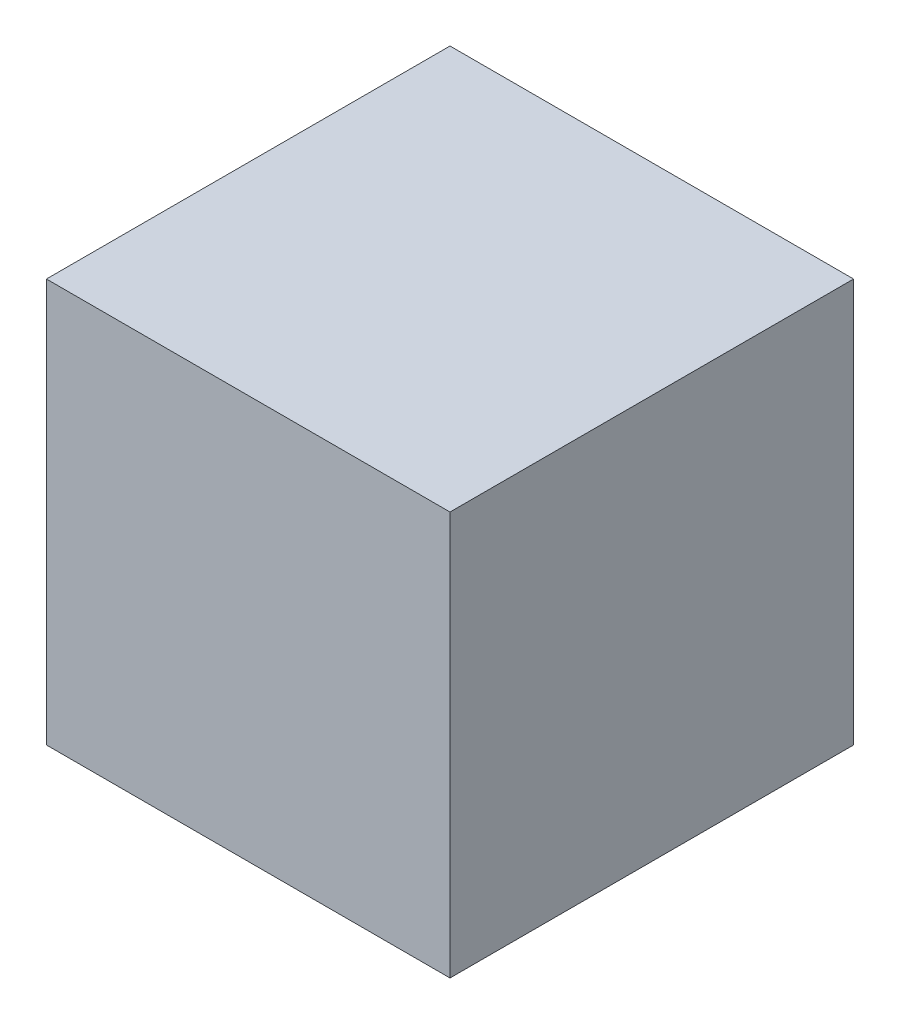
ISO-10303-21;
HEADER;
FILE_DESCRIPTION(('STEP AP214'),'2;1');
FILE_NAME('part.step','',(''),(''),'','','');
FILE_SCHEMA(('AUTOMOTIVE_DESIGN { 1 0 10303 214 1 1 1 1 }'));
ENDSEC;
DATA;
#1=APPLICATION_CONTEXT('core data for automotive mechanical design processes');
#2=APPLICATION_PROTOCOL_DEFINITION('international standard','automotive_design',2000,#1);
#3=PRODUCT_CONTEXT('',#1,'mechanical');
#4=PRODUCT('Part','Part','',(#3));
#5=PRODUCT_RELATED_PRODUCT_CATEGORY('part','',(#4));
#6=PRODUCT_DEFINITION_FORMATION('','',#4);
#7=PRODUCT_DEFINITION_CONTEXT('part definition',#1,'design');
#8=PRODUCT_DEFINITION('design','',#6,#7);
#9=PRODUCT_DEFINITION_SHAPE('','',#8);
#10=(LENGTH_UNIT() NAMED_UNIT(*) SI_UNIT(.MILLI.,.METRE.));
#11=(NAMED_UNIT(*) PLANE_ANGLE_UNIT() SI_UNIT($,.RADIAN.));
#12=(NAMED_UNIT(*) SI_UNIT($,.STERADIAN.) SOLID_ANGLE_UNIT());
#13=UNCERTAINTY_MEASURE_WITH_UNIT(LENGTH_MEASURE(1.E-05),#10,'distance_accuracy_value','');
#14=(GEOMETRIC_REPRESENTATION_CONTEXT(3) GLOBAL_UNCERTAINTY_ASSIGNED_CONTEXT((#13)) GLOBAL_UNIT_ASSIGNED_CONTEXT((#10,
#11,#12)) REPRESENTATION_CONTEXT('',''));
#15=CARTESIAN_POINT('',(0.,0.,0.));
#16=DIRECTION('',(0.,0.,1.));
#17=DIRECTION('',(1.,0.,0.));
#18=AXIS2_PLACEMENT_3D('',#15,#16,#17);
#19=CARTESIAN_POINT('',(-166.666666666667,83.3333333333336,-83.3333333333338));
#20=DIRECTION('',(-0.577350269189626,-0.577350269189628,0.577350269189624));
#21=DIRECTION('',(-0.707106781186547,0.707106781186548,0.));
#22=AXIS2_PLACEMENT_3D('',#19,#20,#21);
#23=PLANE('',#22);
#24=DIRECTION('',(-0.707106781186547,0.,-0.707106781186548));
#25=VECTOR('',#24,1.);
#26=CARTESIAN_POINT('',(-1.66533453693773E-13,250.,250.));
#27=LINE('',#26,#25);
#28=CARTESIAN_POINT('',(0.,250.,250.));
#29=VERTEX_POINT('',#28);
#30=CARTESIAN_POINT('',(-250.,250.,0.));
#31=VERTEX_POINT('',#30);
#32=EDGE_CURVE('E90',#29,#31,#27,.T.);
#33=ORIENTED_EDGE('',*,*,#32,.T.);
#34=DIRECTION('',(0.707106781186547,-0.707106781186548,0.));
#35=VECTOR('',#34,1.);
#36=CARTESIAN_POINT('',(-250.,250.,0.));
#37=LINE('',#36,#35);
#38=CARTESIAN_POINT('',(0.,0.,-3.7470027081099E-13));
#39=VERTEX_POINT('',#38);
#40=EDGE_CURVE('E88',#31,#39,#37,.T.);
#41=ORIENTED_EDGE('',*,*,#40,.T.);
#42=DIRECTION('',(0.,-0.707106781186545,-0.70710678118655));
#43=VECTOR('',#42,1.);
#44=CARTESIAN_POINT('',(1.94289029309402E-13,249.999999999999,250.));
#45=LINE('',#44,#43);
#46=EDGE_CURVE('E56',#29,#39,#45,.T.);
#47=ORIENTED_EDGE('',*,*,#46,.F.);
#48=EDGE_LOOP('',(#33,#41,#47));
#49=FACE_BOUND('',#48,.T.);
#50=ADVANCED_FACE('F53',(#49),#23,.T.);
#51=CARTESIAN_POINT('',(166.666666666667,83.3333333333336,-83.3333333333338));
#52=DIRECTION('',(0.577350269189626,-0.577350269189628,0.577350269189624));
#53=DIRECTION('',(0.707106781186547,0.707106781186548,0.));
#54=AXIS2_PLACEMENT_3D('',#51,#52,#53);
#55=PLANE('',#54);
#56=DIRECTION('',(0.707106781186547,0.,-0.707106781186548));
#57=VECTOR('',#56,1.);
#58=CARTESIAN_POINT('',(1.66533453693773E-13,250.,250.));
#59=LINE('',#58,#57);
#60=CARTESIAN_POINT('',(250.,250.,0.));
#61=VERTEX_POINT('',#60);
#62=EDGE_CURVE('E83',#29,#61,#59,.T.);
#63=ORIENTED_EDGE('',*,*,#62,.F.);
#64=ORIENTED_EDGE('',*,*,#46,.T.);
#65=DIRECTION('',(-0.707106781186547,-0.707106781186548,0.));
#66=VECTOR('',#65,1.);
#67=CARTESIAN_POINT('',(250.,250.,0.));
#68=LINE('',#67,#66);
#69=EDGE_CURVE('E72',#61,#39,#68,.T.);
#70=ORIENTED_EDGE('',*,*,#69,.F.);
#71=EDGE_LOOP('',(#63,#64,#70));
#72=FACE_BOUND('',#71,.T.);
#73=ADVANCED_FACE('F96',(#72),#55,.T.);
#74=CARTESIAN_POINT('',(-166.666666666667,333.333333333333,-166.666666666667));
#75=DIRECTION('',(-0.577350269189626,-0.577350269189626,-0.577350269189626));
#76=DIRECTION('',(-0.707106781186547,0.,0.707106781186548));
#77=AXIS2_PLACEMENT_3D('',#74,#75,#76);
#78=PLANE('',#77);
#79=ORIENTED_EDGE('',*,*,#40,.F.);
#80=DIRECTION('',(0.707106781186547,0.,-0.707106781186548));
#81=VECTOR('',#80,1.);
#82=CARTESIAN_POINT('',(-250.,250.,0.));
#83=LINE('',#82,#81);
#84=CARTESIAN_POINT('',(0.,250.000000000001,-250.));
#85=VERTEX_POINT('',#84);
#86=EDGE_CURVE('E101',#31,#85,#83,.T.);
#87=ORIENTED_EDGE('',*,*,#86,.T.);
#88=DIRECTION('',(0.,0.707106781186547,-0.707106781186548));
#89=VECTOR('',#88,1.);
#90=CARTESIAN_POINT('',(1.94289029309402E-13,0.,0.));
#91=LINE('',#90,#89);
#92=EDGE_CURVE('E98',#39,#85,#91,.T.);
#93=ORIENTED_EDGE('',*,*,#92,.F.);
#94=EDGE_LOOP('',(#79,#87,#93));
#95=FACE_BOUND('',#94,.T.);
#96=ADVANCED_FACE('F99',(#95),#78,.T.);
#97=CARTESIAN_POINT('',(166.666666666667,333.333333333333,-166.666666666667));
#98=DIRECTION('',(0.577350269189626,-0.577350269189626,-0.577350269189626));
#99=DIRECTION('',(0.707106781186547,0.,0.707106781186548));
#100=AXIS2_PLACEMENT_3D('',#97,#98,#99);
#101=PLANE('',#100);
#102=ORIENTED_EDGE('',*,*,#69,.T.);
#103=ORIENTED_EDGE('',*,*,#92,.T.);
#104=DIRECTION('',(-0.707106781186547,0.,-0.707106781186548));
#105=VECTOR('',#104,1.);
#106=CARTESIAN_POINT('',(250.,250.,0.));
#107=LINE('',#106,#105);
#108=EDGE_CURVE('E107',#61,#85,#107,.T.);
#109=ORIENTED_EDGE('',*,*,#108,.F.);
#110=EDGE_LOOP('',(#102,#103,#109));
#111=FACE_BOUND('',#110,.T.);
#112=ADVANCED_FACE('F105',(#111),#101,.T.);
#113=CARTESIAN_POINT('',(-166.666666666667,166.666666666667,166.666666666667));
#114=DIRECTION('',(-0.577350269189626,0.577350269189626,0.577350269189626));
#115=DIRECTION('',(-0.707106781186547,0.,-0.707106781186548));
#116=AXIS2_PLACEMENT_3D('',#113,#114,#115);
#117=PLANE('',#116);
#118=DIRECTION('',(-0.707106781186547,-0.707106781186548,0.));
#119=VECTOR('',#118,1.);
#120=CARTESIAN_POINT('',(-1.66533453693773E-13,500.,2.60902410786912E-12));
#121=LINE('',#120,#119);
#122=CARTESIAN_POINT('',(0.,500.,1.36002320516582E-12));
#123=VERTEX_POINT('',#122);
#124=EDGE_CURVE('E121',#123,#31,#121,.T.);
#125=ORIENTED_EDGE('',*,*,#124,.T.);
#126=ORIENTED_EDGE('',*,*,#32,.F.);
#127=DIRECTION('',(0.,-0.707106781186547,0.707106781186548));
#128=VECTOR('',#127,1.);
#129=CARTESIAN_POINT('',(1.94289029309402E-13,500.,1.11022302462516E-13));
#130=LINE('',#129,#128);
#131=EDGE_CURVE('E116',#123,#29,#130,.T.);
#132=ORIENTED_EDGE('',*,*,#131,.F.);
#133=EDGE_LOOP('',(#125,#126,#132));
#134=FACE_BOUND('',#133,.T.);
#135=ADVANCED_FACE('F140',(#134),#117,.T.);
#136=CARTESIAN_POINT('',(166.666666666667,166.666666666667,166.666666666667));
#137=DIRECTION('',(0.577350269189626,0.577350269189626,0.577350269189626));
#138=DIRECTION('',(0.707106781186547,0.,-0.707106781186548));
#139=AXIS2_PLACEMENT_3D('',#136,#137,#138);
#140=PLANE('',#139);
#141=DIRECTION('',(0.707106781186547,-0.707106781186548,0.));
#142=VECTOR('',#141,1.);
#143=CARTESIAN_POINT('',(1.66533453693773E-13,500.,2.60902410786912E-12));
#144=LINE('',#143,#142);
#145=EDGE_CURVE('E12',#123,#61,#144,.T.);
#146=ORIENTED_EDGE('',*,*,#145,.F.);
#147=ORIENTED_EDGE('',*,*,#131,.T.);
#148=ORIENTED_EDGE('',*,*,#62,.T.);
#149=EDGE_LOOP('',(#146,#147,#148));
#150=FACE_BOUND('',#149,.T.);
#151=ADVANCED_FACE('F137',(#150),#140,.T.);
#152=CARTESIAN_POINT('',(-166.666666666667,416.666666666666,83.3333333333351));
#153=DIRECTION('',(-0.577350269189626,0.577350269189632,-0.57735026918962));
#154=DIRECTION('',(-0.707106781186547,-0.707106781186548,0.));
#155=AXIS2_PLACEMENT_3D('',#152,#153,#154);
#156=PLANE('',#155);
#157=ORIENTED_EDGE('',*,*,#86,.F.);
#158=ORIENTED_EDGE('',*,*,#124,.F.);
#159=DIRECTION('',(0.,0.70710678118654,0.707106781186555));
#160=VECTOR('',#159,1.);
#161=CARTESIAN_POINT('',(1.94289029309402E-13,250.000000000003,-250.));
#162=LINE('',#161,#160);
#163=EDGE_CURVE('E63',#85,#123,#162,.T.);
#164=ORIENTED_EDGE('',*,*,#163,.F.);
#165=EDGE_LOOP('',(#157,#158,#164));
#166=FACE_BOUND('',#165,.T.);
#167=ADVANCED_FACE('F142',(#166),#156,.T.);
#168=CARTESIAN_POINT('',(166.666666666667,416.666666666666,83.3333333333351));
#169=DIRECTION('',(0.577350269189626,0.577350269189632,-0.57735026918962));
#170=DIRECTION('',(0.707106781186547,-0.707106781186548,0.));
#171=AXIS2_PLACEMENT_3D('',#168,#169,#170);
#172=PLANE('',#171);
#173=ORIENTED_EDGE('',*,*,#108,.T.);
#174=ORIENTED_EDGE('',*,*,#163,.T.);
#175=ORIENTED_EDGE('',*,*,#145,.T.);
#176=EDGE_LOOP('',(#173,#174,#175));
#177=FACE_BOUND('',#176,.T.);
#178=ADVANCED_FACE('F134',(#177),#172,.T.);
#179=CLOSED_SHELL('',(#50,#73,#96,#112,#135,#151,#167,#178));
#180=MANIFOLD_SOLID_BREP('B2',#179);
#181=CARTESIAN_POINT('',(-250.,500.,250.));
#182=DIRECTION('',(1.,0.,0.));
#183=DIRECTION('',(0.,0.,-1.));
#184=AXIS2_PLACEMENT_3D('',#181,#182,#183);
#185=PLANE('',#184);
#186=DIRECTION('',(0.,0.,1.));
#187=VECTOR('',#186,1.);
#188=CARTESIAN_POINT('',(-250.,0.,250.));
#189=LINE('',#188,#187);
#190=CARTESIAN_POINT('',(-250.,0.,-250.));
#191=VERTEX_POINT('',#190);
#192=CARTESIAN_POINT('',(-250.,0.,250.));
#193=VERTEX_POINT('',#192);
#194=EDGE_CURVE('E318',#191,#193,#189,.T.);
#195=ORIENTED_EDGE('',*,*,#194,.T.);
#196=DIRECTION('',(0.,-1.,0.));
#197=VECTOR('',#196,1.);
#198=CARTESIAN_POINT('',(-250.,500.,250.));
#199=LINE('',#198,#197);
#200=CARTESIAN_POINT('',(-250.,500.,250.));
#201=VERTEX_POINT('',#200);
#202=EDGE_CURVE('E51',#201,#193,#199,.T.);
#203=ORIENTED_EDGE('',*,*,#202,.F.);
#204=DIRECTION('',(0.,0.,1.));
#205=VECTOR('',#204,1.);
#206=CARTESIAN_POINT('',(-250.,500.,250.));
#207=LINE('',#206,#205);
#208=CARTESIAN_POINT('',(-250.,500.,-250.));
#209=VERTEX_POINT('',#208);
#210=EDGE_CURVE('E306',#209,#201,#207,.T.);
#211=ORIENTED_EDGE('',*,*,#210,.F.);
#212=DIRECTION('',(0.,-1.,0.));
#213=VECTOR('',#212,1.);
#214=CARTESIAN_POINT('',(-250.,500.,-250.));
#215=LINE('',#214,#213);
#216=EDGE_CURVE('E314',#209,#191,#215,.T.);
#217=ORIENTED_EDGE('',*,*,#216,.T.);
#218=EDGE_LOOP('',(#195,#203,#211,#217));
#219=FACE_BOUND('',#218,.T.);
#220=ADVANCED_FACE('F255',(#219),#185,.F.);
#221=CARTESIAN_POINT('',(250.,500.,250.));
#222=DIRECTION('',(0.,0.,-1.));
#223=DIRECTION('',(-1.,0.,0.));
#224=AXIS2_PLACEMENT_3D('',#221,#222,#223);
#225=PLANE('',#224);
#226=DIRECTION('',(1.,0.,0.));
#227=VECTOR('',#226,1.);
#228=CARTESIAN_POINT('',(250.,0.,250.));
#229=LINE('',#228,#227);
#230=CARTESIAN_POINT('',(250.,0.,250.));
#231=VERTEX_POINT('',#230);
#232=EDGE_CURVE('E310',#193,#231,#229,.T.);
#233=ORIENTED_EDGE('',*,*,#232,.T.);
#234=DIRECTION('',(0.,-1.,0.));
#235=VECTOR('',#234,1.);
#236=CARTESIAN_POINT('',(250.,500.,250.));
#237=LINE('',#236,#235);
#238=CARTESIAN_POINT('',(250.,500.,250.));
#239=VERTEX_POINT('',#238);
#240=EDGE_CURVE('E263',#239,#231,#237,.T.);
#241=ORIENTED_EDGE('',*,*,#240,.F.);
#242=DIRECTION('',(1.,0.,0.));
#243=VECTOR('',#242,1.);
#244=CARTESIAN_POINT('',(250.,500.,250.));
#245=LINE('',#244,#243);
#246=EDGE_CURVE('E301',#201,#239,#245,.T.);
#247=ORIENTED_EDGE('',*,*,#246,.F.);
#248=ORIENTED_EDGE('',*,*,#202,.T.);
#249=EDGE_LOOP('',(#233,#241,#247,#248));
#250=FACE_BOUND('',#249,.T.);
#251=ADVANCED_FACE('F309',(#250),#225,.F.);
#252=CARTESIAN_POINT('',(250.,500.,250.));
#253=DIRECTION('',(-1.,0.,0.));
#254=DIRECTION('',(0.,0.,1.));
#255=AXIS2_PLACEMENT_3D('',#252,#253,#254);
#256=PLANE('',#255);
#257=DIRECTION('',(0.,0.,-1.));
#258=VECTOR('',#257,1.);
#259=CARTESIAN_POINT('',(250.,0.,250.));
#260=LINE('',#259,#258);
#261=CARTESIAN_POINT('',(250.,0.,-250.));
#262=VERTEX_POINT('',#261);
#263=EDGE_CURVE('E288',#231,#262,#260,.T.);
#264=ORIENTED_EDGE('',*,*,#263,.T.);
#265=DIRECTION('',(0.,-1.,0.));
#266=VECTOR('',#265,1.);
#267=CARTESIAN_POINT('',(250.,500.,-250.));
#268=LINE('',#267,#266);
#269=CARTESIAN_POINT('',(250.,500.,-250.));
#270=VERTEX_POINT('',#269);
#271=EDGE_CURVE('E311',#270,#262,#268,.T.);
#272=ORIENTED_EDGE('',*,*,#271,.F.);
#273=DIRECTION('',(0.,0.,-1.));
#274=VECTOR('',#273,1.);
#275=CARTESIAN_POINT('',(250.,500.,250.));
#276=LINE('',#275,#274);
#277=EDGE_CURVE('E304',#239,#270,#276,.T.);
#278=ORIENTED_EDGE('',*,*,#277,.F.);
#279=ORIENTED_EDGE('',*,*,#240,.T.);
#280=EDGE_LOOP('',(#264,#272,#278,#279));
#281=FACE_BOUND('',#280,.T.);
#282=ADVANCED_FACE('F312',(#281),#256,.F.);
#283=CARTESIAN_POINT('',(250.,500.,-250.));
#284=DIRECTION('',(0.,0.,1.));
#285=DIRECTION('',(1.,0.,0.));
#286=AXIS2_PLACEMENT_3D('',#283,#284,#285);
#287=PLANE('',#286);
#288=DIRECTION('',(-1.,0.,0.));
#289=VECTOR('',#288,1.);
#290=CARTESIAN_POINT('',(250.,0.,-250.));
#291=LINE('',#290,#289);
#292=EDGE_CURVE('E294',#262,#191,#291,.T.);
#293=ORIENTED_EDGE('',*,*,#292,.T.);
#294=ORIENTED_EDGE('',*,*,#216,.F.);
#295=DIRECTION('',(-1.,0.,0.));
#296=VECTOR('',#295,1.);
#297=CARTESIAN_POINT('',(250.,500.,-250.));
#298=LINE('',#297,#296);
#299=EDGE_CURVE('E271',#270,#209,#298,.T.);
#300=ORIENTED_EDGE('',*,*,#299,.F.);
#301=ORIENTED_EDGE('',*,*,#271,.T.);
#302=EDGE_LOOP('',(#293,#294,#300,#301));
#303=FACE_BOUND('',#302,.T.);
#304=ADVANCED_FACE('F325',(#303),#287,.F.);
#305=CARTESIAN_POINT('',(0.,500.,0.));
#306=DIRECTION('',(0.,1.,0.));
#307=DIRECTION('',(0.,0.,1.));
#308=AXIS2_PLACEMENT_3D('',#305,#306,#307);
#309=PLANE('',#308);
#310=ORIENTED_EDGE('',*,*,#210,.T.);
#311=ORIENTED_EDGE('',*,*,#246,.T.);
#312=ORIENTED_EDGE('',*,*,#277,.T.);
#313=ORIENTED_EDGE('',*,*,#299,.T.);
#314=EDGE_LOOP('',(#310,#311,#312,#313));
#315=FACE_BOUND('',#314,.T.);
#316=ADVANCED_FACE('F302',(#315),#309,.T.);
#317=CARTESIAN_POINT('',(0.,0.,0.));
#318=DIRECTION('',(0.,1.,0.));
#319=DIRECTION('',(0.,0.,1.));
#320=AXIS2_PLACEMENT_3D('',#317,#318,#319);
#321=PLANE('',#320);
#322=ORIENTED_EDGE('',*,*,#194,.F.);
#323=ORIENTED_EDGE('',*,*,#292,.F.);
#324=ORIENTED_EDGE('',*,*,#263,.F.);
#325=ORIENTED_EDGE('',*,*,#232,.F.);
#326=EDGE_LOOP('',(#322,#323,#324,#325));
#327=FACE_BOUND('',#326,.T.);
#328=ADVANCED_FACE('F328',(#327),#321,.F.);
#329=CLOSED_SHELL('',(#220,#251,#282,#304,#316,#328));
#330=MANIFOLD_SOLID_BREP('B6_NOT_SHOWN',#329);
#331=ADVANCED_BREP_SHAPE_REPRESENTATION('',(#18,#180,#330),#14);
#332=SHAPE_DEFINITION_REPRESENTATION(#9,#331);
ENDSEC;
END-ISO-10303-21;
